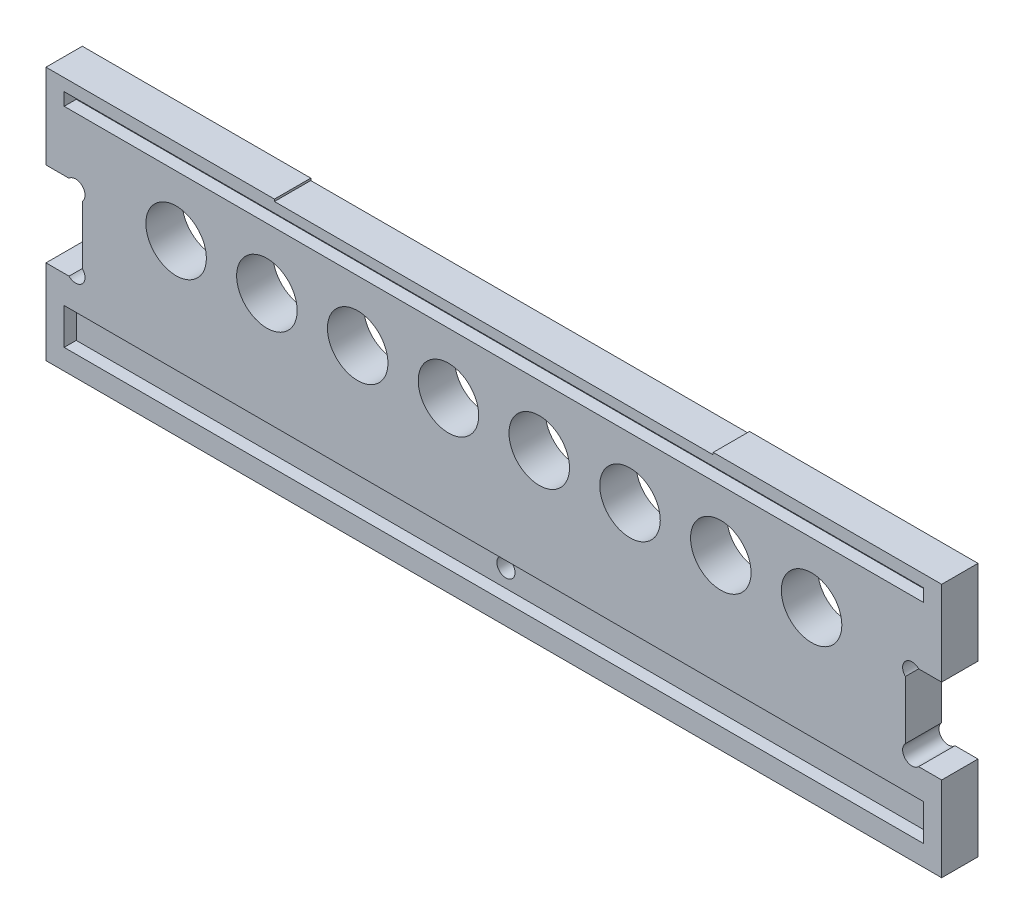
from build123d import *

# Parameters (mm, degrees)
ESQUISSE1_R             = 1.5
ESQUISSE1_R_2           = 5
EXTRUSION1_DEPTH        = 6
ESQUISSE2_W             = 142
ESQUISSE2_H             = 2.10000947
ESQUISSE2_H_2           = 6
ENL_V_MAT_EXTRU_1_DEPTH = 2


with BuildPart() as part:
    # Esquisse1 → Extrusion1 (new body)
    with BuildSketch(Plane.XY):
        with BuildLine():
            Line((0, 42), (37.75, 42))
            Line((37.75, 42), (37.75, 41.65))
            Line((37.75, 41.65), (110.25, 41.65))
            Line((110.25, 41.65), (110.25, 42))
            Line((110.25, 42), (148, 42))
            Line((148, 42), (148, 28))
            Line((148, 28), (144.192031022, 28))
            ThreePointArc((144.192031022, 28), (142, 28), (142, 25.807968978))
            Line((142, 25.807968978), (142, 16.192031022))
            ThreePointArc((142, 16.192031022), (142, 14), (144.192031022, 14))
            Line((144.192031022, 14), (148, 14))
            Line((148, 14), (148, 0))
            Line((148, 0), (0, 0))
            Line((0, 0), (0, 14))
            Line((0, 14), (3.807968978, 14))
            ThreePointArc((3.807968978, 14), (6, 14), (6, 16.192031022))
            Line((6, 16.192031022), (6, 25.807968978))
            ThreePointArc((6, 25.807968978), (6, 28), (3.807968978, 28))
            Line((3.807968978, 28), (0, 28))
            Line((0, 28), (0, 42))
        make_face()
        with Locations((74, 6.397626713)):
            Circle(ESQUISSE1_R, mode=Mode.SUBTRACT)
        with Locations((21.5, 27.899305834)):
            Circle(ESQUISSE1_R_2, mode=Mode.SUBTRACT)
        with Locations((36.5, 27.899305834)):
            Circle(ESQUISSE1_R_2, mode=Mode.SUBTRACT)
        with Locations((51.5, 27.899305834)):
            Circle(ESQUISSE1_R_2, mode=Mode.SUBTRACT)
        with Locations((66.5, 27.899305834)):
            Circle(ESQUISSE1_R_2, mode=Mode.SUBTRACT)
        with Locations((81.5, 27.899305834)):
            Circle(ESQUISSE1_R_2, mode=Mode.SUBTRACT)
        with Locations((96.5, 27.899305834)):
            Circle(ESQUISSE1_R_2, mode=Mode.SUBTRACT)
        with Locations((111.5, 27.899305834)):
            Circle(ESQUISSE1_R_2, mode=Mode.SUBTRACT)
        with Locations((126.5, 27.899305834)):
            Circle(ESQUISSE1_R_2, mode=Mode.SUBTRACT)
    extrude(amount=EXTRUSION1_DEPTH)

    # Esquisse2 → Enl_v. mat.-Extru.1 (cut)
    with BuildSketch(Plane.XY.offset(6)):
        with Locations((74, 38.949995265)):
            Rectangle(ESQUISSE2_W, ESQUISSE2_H)
        with Locations((74, 6.4)):
            Rectangle(ESQUISSE2_W, ESQUISSE2_H_2)
    extrude(amount=-ENL_V_MAT_EXTRU_1_DEPTH, mode=Mode.SUBTRACT)


solid = part.part
